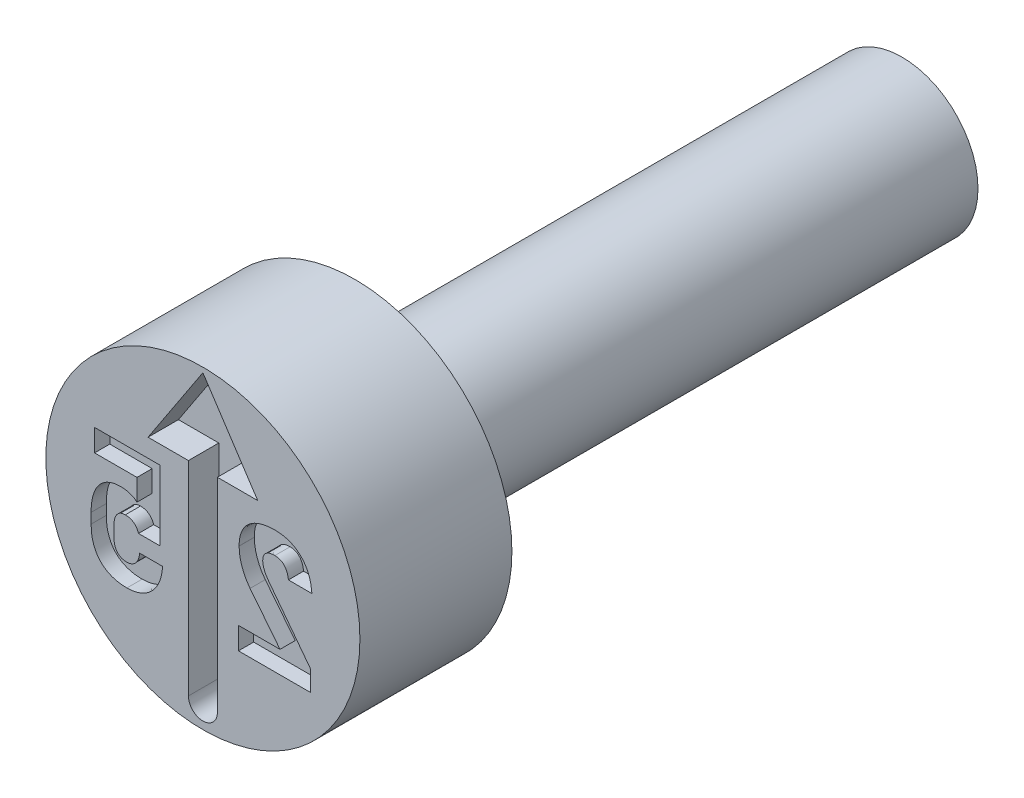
from build123d import *

# Parameters (mm, degrees)
CUT_EXTRUDE4_DEPTH = 0.6
CUT_EXTRUDE5_DEPTH = 0.3


with BuildPart() as part:
    # Sketch2 → Revolve1 (revolve)
    with BuildSketch(Plane(origin=(0, 0, 0), x_dir=(0, 0, -1), z_dir=(1, 0, 0)), mode=Mode.PRIVATE) as revolve1_sk:
        Polygon((0, 3.1), (0, 0), (13.8, 0), (13.8, 1.5), (3, 1.5), (3, 3.1), align=None)
    revolve(revolve1_sk.sketch.rotate(Axis((0, 0, -0.403888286), (0, 0, -1)), 90), axis=Axis((0, 0, -0.403888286), (0, 0, -1)))

    # Sketch3 → Cut-Extrude4 (cut)
    with BuildSketch(Plane.XY):
        with BuildLine():
            Line((0.285709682, 1.359527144), (0.285709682, -2.664242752))
            ThreePointArc((0.285709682, -2.664242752), (0, -2.949952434), (-0.285709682, -2.664242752))
            Line((-0.285709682, -2.664242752), (-0.285709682, 1.359527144))
            Line((-0.285709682, 1.359527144), (-1.082876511, 1.359527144))
            Line((-1.082876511, 1.359527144), (0, 3.00317302))
            Line((0, 3.00317302), (1.082876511, 1.359527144))
            Line((1.082876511, 1.359527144), (0.285709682, 1.359527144))
        make_face()
    extrude(amount=-CUT_EXTRUDE4_DEPTH, mode=Mode.SUBTRACT)

    # Sketch4 → Cut-Extrude5 (cut)
    with BuildSketch(Plane.XY):
        with BuildLine():
            Line((2.121479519, -0.992092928), (1.297839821, 0.09076829))
            add(Edge.make_bspline(
                [(1.297839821, 0.09076829), (1.28056586, 0.114734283), (1.246843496, 0.161520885), (1.216672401, 0.226052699), (1.197505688, 0.276652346), (1.188644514, 0.313356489), (1.182084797, 0.348453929), (1.181320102, 0.371481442), (1.180945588, 0.382759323)],
                knots=[0, 0, 0, 0, 1.660423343, 3.241491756, 3.993801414, 4.704207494, 5.365376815, 6, 6, 6, 6], degree=3))
            Line((1.180945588, 0.382759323), (1.180945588, 0.386183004))
            add(Edge.make_bspline(
                [(1.180945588, 0.386183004), (1.181601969, 0.401594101), (1.18285281, 0.430962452), (1.194928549, 0.472280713), (1.214897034, 0.508009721), (1.24286747, 0.537960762), (1.278446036, 0.560979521), (1.320413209, 0.577794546), (1.368992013, 0.587308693), (1.403442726, 0.588520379), (1.421581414, 0.589158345)],
                knots=[0, 0, 0, 0, 1.033361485, 1.969238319, 2.861873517, 3.760870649, 4.693536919, 5.686153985, 6.781734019, 8, 8, 8, 8], degree=3))
            add(Edge.make_bspline(
                [(1.421581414, 0.589158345), (1.439442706, 0.588403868), (1.474105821, 0.586939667), (1.523414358, 0.572987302), (1.5672168, 0.549300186), (1.605134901, 0.516564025), (1.636951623, 0.475381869), (1.660402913, 0.425770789), (1.679288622, 0.36938568), (1.684769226, 0.328462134), (1.687650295, 0.306949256)],
                knots=[0, 0, 0, 0, 0.993701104, 1.928459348, 2.826878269, 3.748294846, 4.700551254, 5.70417143, 6.793118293, 8, 8, 8, 8], degree=3))
            Line((1.687650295, 0.306949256), (1.687650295, 0.304992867))
            Line((1.687650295, 0.304992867), (2.151314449, 0.304992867))
            Line((2.151314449, 0.304992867), (2.151314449, 0.306949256))
            add(Edge.make_bspline(
                [(2.151314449, 0.306949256), (2.147992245, 0.343080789), (2.141520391, 0.413467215), (2.119514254, 0.514688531), (2.087004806, 0.607827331), (2.045469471, 0.69314069), (1.994539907, 0.769551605), (1.93544646, 0.837039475), (1.867534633, 0.894293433), (1.791980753, 0.941869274), (1.709114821, 0.979102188), (1.619950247, 1.006230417), (1.524352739, 1.021869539), (1.458646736, 1.023902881), (1.425005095, 1.024943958)],
                knots=[0, 0, 0, 0, 1.143950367, 2.228484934, 3.258162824, 4.249580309, 5.213917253, 6.146796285, 7.070112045, 8.006232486, 8.954636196, 9.927630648, 10.9389416, 12, 12, 12, 12], degree=3))
            add(Edge.make_bspline(
                [(1.425005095, 1.024943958), (1.388930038, 1.024189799), (1.319108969, 1.022730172), (1.218571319, 1.008989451), (1.126125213, 0.986123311), (1.042002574, 0.953997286), (0.966755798, 0.912700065), (0.900036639, 0.863680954), (0.843728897, 0.805037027), (0.796891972, 0.738416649), (0.759970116, 0.66407689), (0.734113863, 0.582081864), (0.718279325, 0.493090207), (0.716329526, 0.431247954), (0.715325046, 0.399388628)],
                knots=[0, 0, 0, 0, 1.208591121, 2.339154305, 3.392741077, 4.394302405, 5.348037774, 6.261656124, 7.158186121, 8.060194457, 8.981460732, 9.928425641, 10.932785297, 12, 12, 12, 12], degree=3))
            Line((0.715325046, 0.399388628), (0.715325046, 0.39743224))
            add(Edge.make_bspline(
                [(0.715325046, 0.39743224), (0.715952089, 0.370171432), (0.717207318, 0.315600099), (0.728402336, 0.234072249), (0.746707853, 0.153015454), (0.771545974, 0.072713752), (0.802561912, -0.005491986), (0.839577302, -0.080355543), (0.881837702, -0.151685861), (0.914952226, -0.195799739), (0.931506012, -0.217852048)],
                knots=[0, 0, 0, 0, 0.985191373, 1.972179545, 2.968870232, 3.986806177, 5.007996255, 6.007036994, 7.003727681, 8, 8, 8, 8], degree=3))
            Line((0.931506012, -0.217852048), (1.522335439, -0.964214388))
            Line((1.522335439, -0.964214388), (0.702119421, -0.964214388))
            Line((0.702119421, -0.964214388), (0.702119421, -1.4))
            Line((0.702119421, -1.4), (2.121479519, -1.4))
            Line((2.121479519, -1.4), (2.121479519, -0.992092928))
        make_face()
        with BuildLine():
            add(Edge.make_bspline(
                [(-1.49909191, -1.424943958), (-1.467548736, -1.423981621), (-1.405824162, -1.422098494), (-1.315851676, -1.4051932), (-1.230554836, -1.379012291), (-1.150567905, -1.34166344), (-1.076760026, -1.294212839), (-1.01076294, -1.236188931), (-0.9519713, -1.169110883), (-0.901564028, -1.092391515), (-0.860051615, -1.006851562), (-0.827733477, -0.913499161), (-0.80553611, -0.812502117), (-0.799082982, -0.742432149), (-0.795770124, -0.706460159)],
                knots=[0, 0, 0, 0, 1.013165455, 1.982590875, 2.932437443, 3.87502652, 4.811241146, 5.743574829, 6.690699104, 7.67044025, 8.68537997, 9.739549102, 10.839546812, 12, 12, 12, 12], degree=3))
            Line((-0.795770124, -0.706460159), (-0.795770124, -0.704992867))
            Line((-0.795770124, -0.704992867), (-1.248185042, -0.704992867))
            Line((-1.248185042, -0.704992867), (-1.248185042, -0.706460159))
            add(Edge.make_bspline(
                [(-1.248185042, -0.706460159), (-1.25076775, -0.72746659), (-1.255689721, -0.767499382), (-1.273438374, -0.823053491), (-1.296610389, -0.871885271), (-1.3272188, -0.912859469), (-1.363566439, -0.94612468), (-1.406637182, -0.968685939), (-1.454239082, -0.983740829), (-1.488047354, -0.985057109), (-1.505450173, -0.985734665)],
                knots=[0, 0, 0, 0, 1.202223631, 2.291125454, 3.30376979, 4.265156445, 5.185306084, 6.082185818, 7.012804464, 8, 8, 8, 8], degree=3))
            add(Edge.make_bspline(
                [(-1.505450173, -0.985734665), (-1.524313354, -0.984912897), (-1.56039373, -0.983341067), (-1.610966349, -0.968170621), (-1.654991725, -0.943882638), (-1.691356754, -0.90893346), (-1.720366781, -0.86538723), (-1.740901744, -0.81324048), (-1.753063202, -0.753320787), (-1.754259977, -0.710760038), (-1.754889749, -0.688363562)],
                knots=[0, 0, 0, 0, 1.026088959, 1.96264217, 2.850204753, 3.743092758, 4.68486217, 5.681854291, 6.780136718, 8, 8, 8, 8], degree=3))
            Line((-1.754889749, -0.688363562), (-1.754889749, -0.48734461))
            add(Edge.make_bspline(
                [(-1.754889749, -0.48734461), (-1.754406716, -0.46494955), (-1.753489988, -0.422446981), (-1.742085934, -0.362992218), (-1.724354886, -0.311119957), (-1.6981686, -0.268059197), (-1.665616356, -0.233302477), (-1.626224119, -0.208616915), (-1.580783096, -0.194037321), (-1.548600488, -0.192329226), (-1.531861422, -0.191440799)],
                knots=[0, 0, 0, 0, 1.281587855, 2.432267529, 3.454745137, 4.406485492, 5.298532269, 6.159104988, 7.042499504, 8, 8, 8, 8], degree=3))
            add(Edge.make_bspline(
                [(-1.531861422, -0.191440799), (-1.516159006, -0.191919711), (-1.485759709, -0.192846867), (-1.44198948, -0.202447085), (-1.40176032, -0.218154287), (-1.36552891, -0.24036175), (-1.333528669, -0.267579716), (-1.307182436, -0.300467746), (-1.285096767, -0.3376294), (-1.275881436, -0.365501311), (-1.271172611, -0.379743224)],
                knots=[0, 0, 0, 0, 1.085085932, 2.100686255, 3.083167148, 4.060192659, 5.028057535, 5.974180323, 6.964852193, 8, 8, 8, 8], degree=3))
            Line((-1.271172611, -0.379743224), (-0.848592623, -0.379743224))
            Line((-0.848592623, -0.379743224), (-0.848592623, 1))
            Line((-0.848592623, 1), (-2.137852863, 1))
            Line((-2.137852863, 1), (-2.137852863, 0.564214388))
            Line((-2.137852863, 0.564214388), (-1.30100754, 0.564214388))
            Line((-1.30100754, 0.564214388), (-1.30100754, 0.140167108))
            add(Edge.make_bspline(
                [(-1.30100754, 0.140167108), (-1.31011316, 0.148229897), (-1.328844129, 0.164815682), (-1.361591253, 0.185875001), (-1.399043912, 0.203761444), (-1.454308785, 0.224361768), (-1.527007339, 0.242680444), (-1.586687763, 0.245765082), (-1.615986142, 0.247279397)],
                knots=[0, 0, 0, 0, 0.643749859, 1.324243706, 2.054464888, 2.839075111, 4.448235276, 6, 6, 6, 6], degree=3))
            add(Edge.make_bspline(
                [(-1.615986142, 0.247279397), (-1.646064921, 0.246327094), (-1.704402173, 0.244480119), (-1.788548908, 0.227866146), (-1.866097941, 0.201248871), (-1.936409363, 0.162901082), (-1.999562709, 0.114837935), (-2.054416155, 0.05610869), (-2.101311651, -0.012329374), (-2.139691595, -0.090522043), (-2.169898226, -0.177784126), (-2.191838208, -0.273506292), (-2.204341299, -0.377781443), (-2.205971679, -0.449976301), (-2.20681557, -0.48734461)],
                knots=[0, 0, 0, 0, 1.012739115, 1.964189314, 2.878178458, 3.765675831, 4.65138573, 5.541464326, 6.461953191, 7.437418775, 8.467828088, 9.567356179, 10.740855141, 12, 12, 12, 12], degree=3))
            Line((-2.20681557, -0.48734461), (-2.20681557, -0.688363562))
            add(Edge.make_bspline(
                [(-2.20681557, -0.688363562), (-2.205744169, -0.725742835), (-2.203671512, -0.798054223), (-2.188849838, -0.902621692), (-2.162130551, -0.998540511), (-2.126330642, -1.086430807), (-2.079583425, -1.164546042), (-2.023606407, -1.233546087), (-1.95737806, -1.291837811), (-1.882461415, -1.340895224), (-1.798143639, -1.378518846), (-1.705772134, -1.405851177), (-1.604981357, -1.422108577), (-1.535183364, -1.423977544), (-1.49909191, -1.424943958)],
                knots=[0, 0, 0, 0, 1.159103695, 2.242322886, 3.265299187, 4.239894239, 5.17631577, 6.078070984, 6.98412447, 7.901225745, 8.844758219, 9.836512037, 10.881294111, 12, 12, 12, 12], degree=3))
        make_face()
    extrude(amount=-CUT_EXTRUDE5_DEPTH, mode=Mode.SUBTRACT)


solid = part.part
